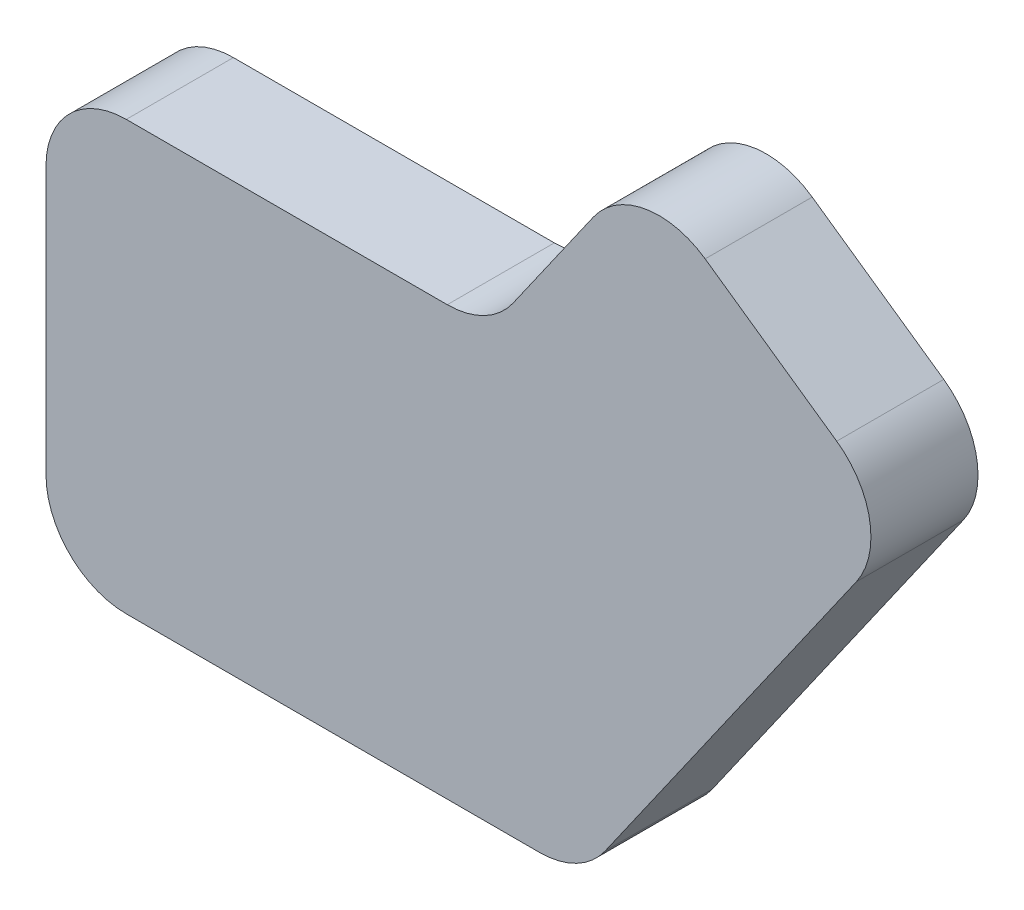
from build123d import *

# Parameters (mm, degrees)
EXTRUDE1_DEPTH = 6.35


with BuildPart() as part:
    # Sketch1 → Extrude1 (new body)
    with BuildSketch(Plane.XY):
        with BuildLine():
            Line((4.7625, 0), (29.270799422, 0))
            ThreePointArc((29.270799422, 0), (31.469877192, 0.538110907), (33.172011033, 2.030842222))
            Line((33.172011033, 2.030842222), (48.068342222, 23.305007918))
            ThreePointArc((48.068342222, 23.305007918), (48.857277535, 26.863665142), (46.898788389, 29.937877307))
            Line((46.898788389, 29.937877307), (39.096365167, 35.401192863))
            ThreePointArc((39.096365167, 35.401192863), (35.537707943, 36.190128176), (32.463495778, 34.23163903))
            Line((32.463495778, 34.23163903), (27.701526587, 27.430842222))
            ThreePointArc((27.701526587, 27.430842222), (25.999392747, 25.938110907), (23.800314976, 25.4))
            Line((23.800314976, 25.4), (4.7625, 25.4))
            ThreePointArc((4.7625, 25.4), (1.394903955, 24.005096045), (0, 20.6375))
            Line((0, 20.6375), (0, 4.7625))
            ThreePointArc((0, 4.7625), (1.394903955, 1.394903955), (4.7625, 0))
        make_face()
    extrude(amount=EXTRUDE1_DEPTH)


solid = part.part
